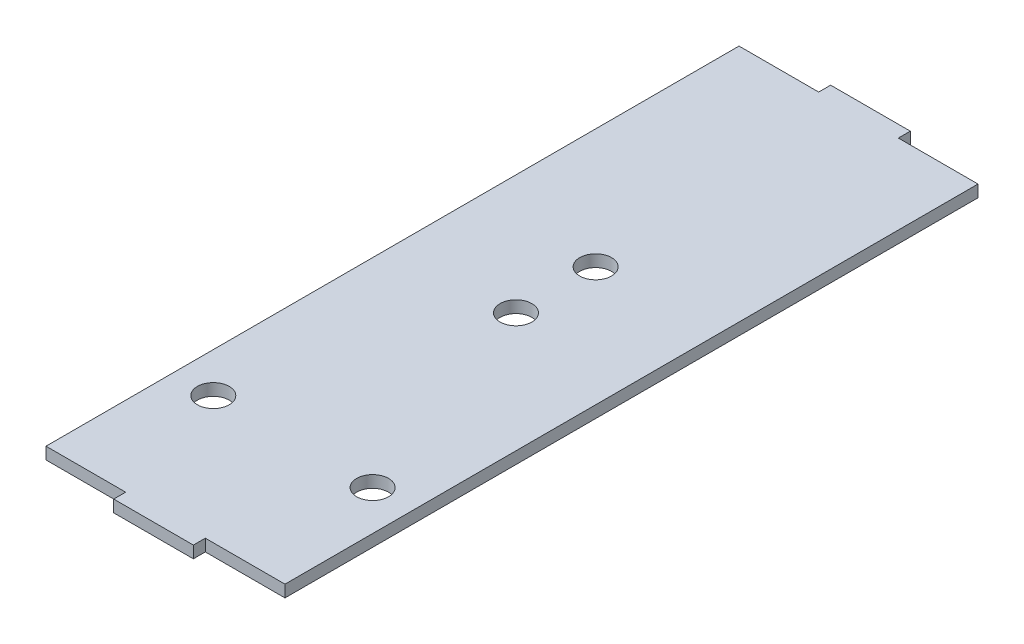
from build123d import *

# Parameters (mm, degrees)
ESQUISSE1_W             = 60
ESQUISSE1_H             = 180
BOSS_EXTRU_1_DEPTH      = 3
ESQUISSE2_W             = 20
ESQUISSE2_H             = 3
ENL_V_MAT_EXTRU_1_DEPTH = 95.915752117
ESQUISSE3_R             = 4
ENL_V_MAT_EXTRU_2_DEPTH = 95.915752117


with BuildPart() as part:
    # Esquisse1 → Boss.-Extru.1 (new body)
    with BuildSketch(Plane(origin=(0, 0, 0), x_dir=(1, 0, 0), z_dir=(0, 1, 0))):
        Rectangle(ESQUISSE1_W, ESQUISSE1_H)
    extrude(amount=BOSS_EXTRU_1_DEPTH)

    # Esquisse2 → Enl_v. mat.-Extru.1 (cut, through all)
    with BuildSketch(Plane(origin=(0, 3, 0), x_dir=(1, 0, 0), z_dir=(0, 1, 0))):
        with Locations((20, 88.5)):
            Rectangle(ESQUISSE2_W, ESQUISSE2_H)
        with Locations((-20, 88.5)):
            Rectangle(ESQUISSE2_W, ESQUISSE2_H)
        with Locations((20, -88.5)):
            Rectangle(ESQUISSE2_W, ESQUISSE2_H)
        with Locations((-20, -88.5)):
            Rectangle(ESQUISSE2_W, ESQUISSE2_H)
    extrude(amount=-ENL_V_MAT_EXTRU_1_DEPTH, mode=Mode.SUBTRACT)

    # Esquisse3 → Enl_v. mat.-Extru.2 (cut, through all)
    with BuildSketch(Plane(origin=(0, 3, 0), x_dir=(1, 0, 0), z_dir=(0, 1, 0))):
        with Locations(Location((-20, -55, 0), (0, 0, 270))):
            Circle(ESQUISSE3_R)
        with Locations(Location((20, -55, 0), (0, 0, 270))):
            Circle(ESQUISSE3_R)
        with Locations(Location((0, 21, 0), (0, 0, 270))):
            Circle(ESQUISSE3_R)
        with Locations(Location((0, 1, 0), (0, 0, 270))):
            Circle(ESQUISSE3_R)
    extrude(amount=-ENL_V_MAT_EXTRU_2_DEPTH, mode=Mode.SUBTRACT)


solid = part.part
